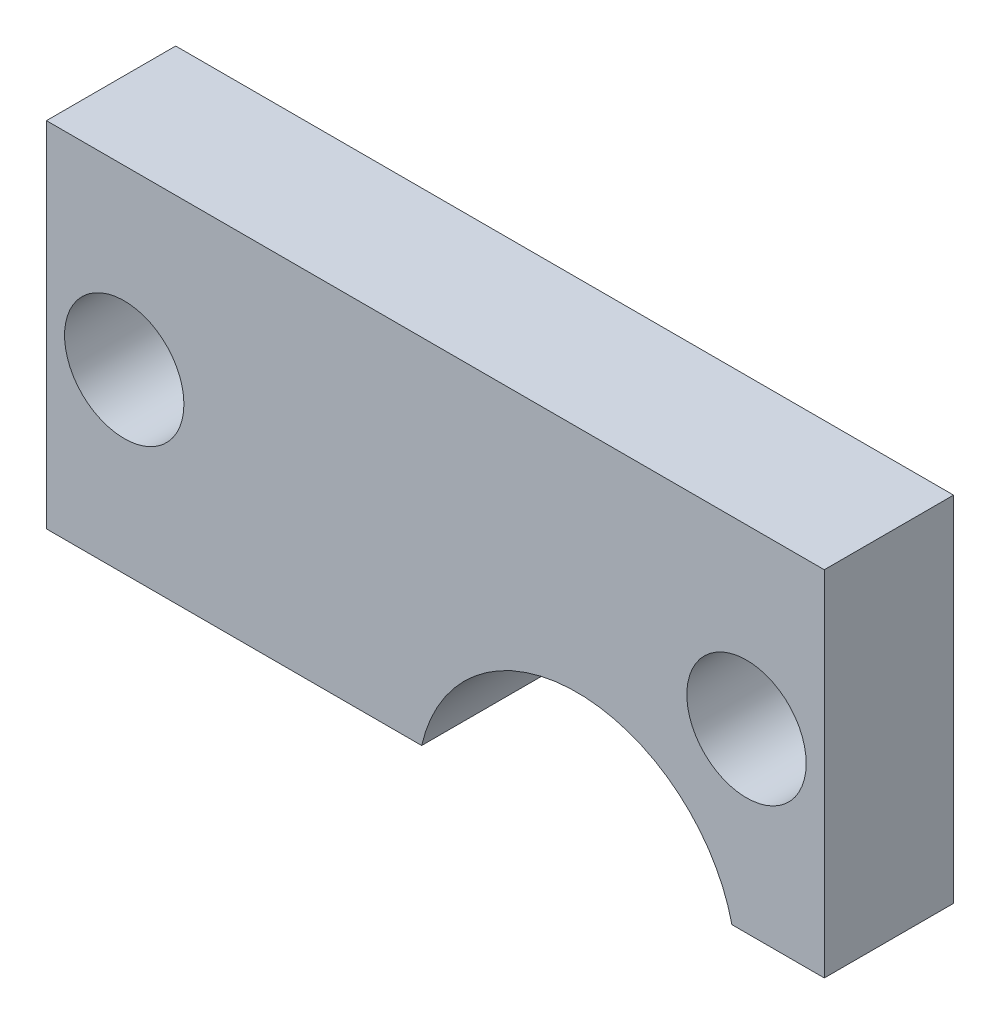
ISO-10303-21;
HEADER;
FILE_DESCRIPTION(('STEP AP214'),'2;1');
FILE_NAME('part.step','',(''),(''),'','','');
FILE_SCHEMA(('AUTOMOTIVE_DESIGN { 1 0 10303 214 1 1 1 1 }'));
ENDSEC;
DATA;
#1=APPLICATION_CONTEXT('core data for automotive mechanical design processes');
#2=APPLICATION_PROTOCOL_DEFINITION('international standard','automotive_design',2000,#1);
#3=PRODUCT_CONTEXT('',#1,'mechanical');
#4=PRODUCT('Part','Part','',(#3));
#5=PRODUCT_RELATED_PRODUCT_CATEGORY('part','',(#4));
#6=PRODUCT_DEFINITION_FORMATION('','',#4);
#7=PRODUCT_DEFINITION_CONTEXT('part definition',#1,'design');
#8=PRODUCT_DEFINITION('design','',#6,#7);
#9=PRODUCT_DEFINITION_SHAPE('','',#8);
#10=(LENGTH_UNIT() NAMED_UNIT(*) SI_UNIT(.MILLI.,.METRE.));
#11=(NAMED_UNIT(*) PLANE_ANGLE_UNIT() SI_UNIT($,.RADIAN.));
#12=(NAMED_UNIT(*) SI_UNIT($,.STERADIAN.) SOLID_ANGLE_UNIT());
#13=UNCERTAINTY_MEASURE_WITH_UNIT(LENGTH_MEASURE(1.E-05),#10,'distance_accuracy_value','');
#14=(GEOMETRIC_REPRESENTATION_CONTEXT(3) GLOBAL_UNCERTAINTY_ASSIGNED_CONTEXT((#13)) GLOBAL_UNIT_ASSIGNED_CONTEXT((#10,
#11,#12)) REPRESENTATION_CONTEXT('',''));
#15=CARTESIAN_POINT('',(0.,0.,0.));
#16=DIRECTION('',(0.,0.,1.));
#17=DIRECTION('',(1.,0.,0.));
#18=AXIS2_PLACEMENT_3D('',#15,#16,#17);
#19=CARTESIAN_POINT('',(-693.42,-152.4,11.6082064));
#20=DIRECTION('',(0.,1.,0.));
#21=DIRECTION('',(0.,0.,1.));
#22=AXIS2_PLACEMENT_3D('',#19,#20,#21);
#23=PLANE('',#22);
#24=DIRECTION('',(1.,0.,0.));
#25=VECTOR('',#24,1.);
#26=CARTESIAN_POINT('',(-693.42,-152.4,0.));
#27=LINE('',#26,#25);
#28=CARTESIAN_POINT('',(-693.42,-152.4,0.));
#29=VERTEX_POINT('',#28);
#30=CARTESIAN_POINT('',(-659.725255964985,-152.4,0.));
#31=VERTEX_POINT('',#30);
#32=EDGE_CURVE('E131',#29,#31,#27,.T.);
#33=ORIENTED_EDGE('',*,*,#32,.T.);
#34=DIRECTION('',(0.,0.,1.));
#35=VECTOR('',#34,1.);
#36=CARTESIAN_POINT('',(-659.725255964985,-152.4,0.));
#37=LINE('',#36,#35);
#38=CARTESIAN_POINT('',(-659.725255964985,-152.4,11.6082064));
#39=VERTEX_POINT('',#38);
#40=EDGE_CURVE('E63',#31,#39,#37,.T.);
#41=ORIENTED_EDGE('',*,*,#40,.T.);
#42=DIRECTION('',(1.,0.,0.));
#43=VECTOR('',#42,1.);
#44=CARTESIAN_POINT('',(-693.42,-152.4,11.6082064));
#45=LINE('',#44,#43);
#46=CARTESIAN_POINT('',(-693.42,-152.4,11.6082064));
#47=VERTEX_POINT('',#46);
#48=EDGE_CURVE('E99',#47,#39,#45,.T.);
#49=ORIENTED_EDGE('',*,*,#48,.F.);
#50=DIRECTION('',(0.,0.,-1.));
#51=VECTOR('',#50,1.);
#52=CARTESIAN_POINT('',(-693.42,-152.4,11.6082064));
#53=LINE('',#52,#51);
#54=EDGE_CURVE('E11',#47,#29,#53,.T.);
#55=ORIENTED_EDGE('',*,*,#54,.T.);
#56=EDGE_LOOP('',(#33,#41,#49,#55));
#57=FACE_BOUND('',#56,.T.);
#58=ADVANCED_FACE('F47',(#57),#23,.F.);
#59=CARTESIAN_POINT('',(-693.42,-120.65,11.6082064));
#60=DIRECTION('',(1.,0.,0.));
#61=DIRECTION('',(0.,0.,-1.));
#62=AXIS2_PLACEMENT_3D('',#59,#60,#61);
#63=PLANE('',#62);
#64=DIRECTION('',(0.,-1.,0.));
#65=VECTOR('',#64,1.);
#66=CARTESIAN_POINT('',(-693.42,-120.65,0.));
#67=LINE('',#66,#65);
#68=CARTESIAN_POINT('',(-693.42,-120.65,0.));
#69=VERTEX_POINT('',#68);
#70=EDGE_CURVE('E132',#69,#29,#67,.T.);
#71=ORIENTED_EDGE('',*,*,#70,.T.);
#72=ORIENTED_EDGE('',*,*,#54,.F.);
#73=DIRECTION('',(0.,-1.,0.));
#74=VECTOR('',#73,1.);
#75=CARTESIAN_POINT('',(-693.42,-120.65,11.6082064));
#76=LINE('',#75,#74);
#77=CARTESIAN_POINT('',(-693.42,-120.65,11.6082064));
#78=VERTEX_POINT('',#77);
#79=EDGE_CURVE('E146',#78,#47,#76,.T.);
#80=ORIENTED_EDGE('',*,*,#79,.F.);
#81=DIRECTION('',(0.,0.,-1.));
#82=VECTOR('',#81,1.);
#83=CARTESIAN_POINT('',(-693.42,-120.65,11.6082064));
#84=LINE('',#83,#82);
#85=EDGE_CURVE('E147',#78,#69,#84,.T.);
#86=ORIENTED_EDGE('',*,*,#85,.T.);
#87=EDGE_LOOP('',(#71,#72,#80,#86));
#88=FACE_BOUND('',#87,.T.);
#89=ADVANCED_FACE('F49',(#88),#63,.F.);
#90=CARTESIAN_POINT('',(-631.864744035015,-152.4,11.6082064));
#91=VERTEX_POINT('',#90);
#92=CARTESIAN_POINT('',(-623.57,-152.4,11.6082064));
#93=VERTEX_POINT('',#92);
#94=EDGE_CURVE('E124',#91,#93,#45,.T.);
#95=ORIENTED_EDGE('',*,*,#94,.F.);
#96=DIRECTION('',(0.,0.,1.));
#97=VECTOR('',#96,1.);
#98=CARTESIAN_POINT('',(-631.864744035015,-152.4,0.));
#99=LINE('',#98,#97);
#100=CARTESIAN_POINT('',(-631.864744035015,-152.4,0.));
#101=VERTEX_POINT('',#100);
#102=EDGE_CURVE('E110',#91,#101,#99,.F.);
#103=ORIENTED_EDGE('',*,*,#102,.T.);
#104=CARTESIAN_POINT('',(-623.57,-152.4,0.));
#105=VERTEX_POINT('',#104);
#106=EDGE_CURVE('E122',#101,#105,#27,.T.);
#107=ORIENTED_EDGE('',*,*,#106,.T.);
#108=DIRECTION('',(0.,0.,-1.));
#109=VECTOR('',#108,1.);
#110=CARTESIAN_POINT('',(-623.57,-152.4,11.6082064));
#111=LINE('',#110,#109);
#112=EDGE_CURVE('E56',#93,#105,#111,.T.);
#113=ORIENTED_EDGE('',*,*,#112,.F.);
#114=EDGE_LOOP('',(#95,#103,#107,#113));
#115=FACE_BOUND('',#114,.T.);
#116=ADVANCED_FACE('F120',(#115),#23,.F.);
#117=CARTESIAN_POINT('',(-623.57,-120.65,11.6082064));
#118=DIRECTION('',(-1.,0.,0.));
#119=DIRECTION('',(0.,0.,1.));
#120=AXIS2_PLACEMENT_3D('',#117,#118,#119);
#121=PLANE('',#120);
#122=DIRECTION('',(0.,1.,0.));
#123=VECTOR('',#122,1.);
#124=CARTESIAN_POINT('',(-623.57,-120.65,0.));
#125=LINE('',#124,#123);
#126=CARTESIAN_POINT('',(-623.57,-120.65,0.));
#127=VERTEX_POINT('',#126);
#128=EDGE_CURVE('E129',#105,#127,#125,.T.);
#129=ORIENTED_EDGE('',*,*,#128,.T.);
#130=DIRECTION('',(0.,0.,-1.));
#131=VECTOR('',#130,1.);
#132=CARTESIAN_POINT('',(-623.57,-120.65,11.6082064));
#133=LINE('',#132,#131);
#134=CARTESIAN_POINT('',(-623.57,-120.65,11.6082064));
#135=VERTEX_POINT('',#134);
#136=EDGE_CURVE('E150',#135,#127,#133,.T.);
#137=ORIENTED_EDGE('',*,*,#136,.F.);
#138=DIRECTION('',(0.,1.,0.));
#139=VECTOR('',#138,1.);
#140=CARTESIAN_POINT('',(-623.57,-120.65,11.6082064));
#141=LINE('',#140,#139);
#142=EDGE_CURVE('E158',#93,#135,#141,.T.);
#143=ORIENTED_EDGE('',*,*,#142,.F.);
#144=ORIENTED_EDGE('',*,*,#112,.T.);
#145=EDGE_LOOP('',(#129,#137,#143,#144));
#146=FACE_BOUND('',#145,.T.);
#147=ADVANCED_FACE('F156',(#146),#121,.F.);
#148=CARTESIAN_POINT('',(-693.42,-120.65,11.6082064));
#149=DIRECTION('',(0.,-1.,0.));
#150=DIRECTION('',(0.,0.,-1.));
#151=AXIS2_PLACEMENT_3D('',#148,#149,#150);
#152=PLANE('',#151);
#153=DIRECTION('',(-1.,0.,0.));
#154=VECTOR('',#153,1.);
#155=CARTESIAN_POINT('',(-693.42,-120.65,0.));
#156=LINE('',#155,#154);
#157=EDGE_CURVE('E93',#127,#69,#156,.T.);
#158=ORIENTED_EDGE('',*,*,#157,.T.);
#159=ORIENTED_EDGE('',*,*,#85,.F.);
#160=DIRECTION('',(-1.,0.,0.));
#161=VECTOR('',#160,1.);
#162=CARTESIAN_POINT('',(-693.42,-120.65,11.6082064));
#163=LINE('',#162,#161);
#164=EDGE_CURVE('E72',#135,#78,#163,.T.);
#165=ORIENTED_EDGE('',*,*,#164,.F.);
#166=ORIENTED_EDGE('',*,*,#136,.T.);
#167=EDGE_LOOP('',(#158,#159,#165,#166));
#168=FACE_BOUND('',#167,.T.);
#169=ADVANCED_FACE('F209',(#168),#152,.F.);
#170=CARTESIAN_POINT('',(0.,0.,11.6082064));
#171=DIRECTION('',(0.,0.,1.));
#172=DIRECTION('',(1.,0.,0.));
#173=AXIS2_PLACEMENT_3D('',#170,#171,#172);
#174=PLANE('',#173);
#175=CARTESIAN_POINT('',(-645.795,-155.575,11.6082064));
#176=DIRECTION('',(0.,0.,1.));
#177=DIRECTION('',(1.,0.,0.));
#178=AXIS2_PLACEMENT_3D('',#175,#176,#177);
#179=CIRCLE('',#178,14.2875);
#180=EDGE_CURVE('E116',#91,#39,#179,.T.);
#181=ORIENTED_EDGE('',*,*,#180,.F.);
#182=ORIENTED_EDGE('',*,*,#94,.T.);
#183=ORIENTED_EDGE('',*,*,#142,.T.);
#184=ORIENTED_EDGE('',*,*,#164,.T.);
#185=ORIENTED_EDGE('',*,*,#79,.T.);
#186=ORIENTED_EDGE('',*,*,#48,.T.);
#187=EDGE_LOOP('',(#181,#182,#183,#184,#185,#186));
#188=FACE_BOUND('',#187,.T.);
#189=CARTESIAN_POINT('',(-686.435,-136.525,11.6082064));
#190=DIRECTION('',(0.,0.,1.));
#191=DIRECTION('',(1.,0.,0.));
#192=AXIS2_PLACEMENT_3D('',#189,#190,#191);
#193=CIRCLE('',#192,5.35940000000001);
#194=CARTESIAN_POINT('',(-681.0756,-136.525,11.6082064));
#195=VERTEX_POINT('',#194);
#196=EDGE_CURVE('E183',#195,#195,#193,.T.);
#197=ORIENTED_EDGE('',*,*,#196,.F.);
#198=EDGE_LOOP('',(#197));
#199=FACE_BOUND('',#198,.T.);
#200=CARTESIAN_POINT('',(-630.555,-136.525,11.6082064));
#201=DIRECTION('',(0.,0.,1.));
#202=DIRECTION('',(1.,0.,0.));
#203=AXIS2_PLACEMENT_3D('',#200,#201,#202);
#204=CIRCLE('',#203,5.35940000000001);
#205=CARTESIAN_POINT('',(-625.1956,-136.525,11.6082064));
#206=VERTEX_POINT('',#205);
#207=EDGE_CURVE('E138',#206,#206,#204,.T.);
#208=ORIENTED_EDGE('',*,*,#207,.F.);
#209=EDGE_LOOP('',(#208));
#210=FACE_BOUND('',#209,.T.);
#211=ADVANCED_FACE('F203',(#188,#199,#210),#174,.T.);
#212=CARTESIAN_POINT('',(0.,0.,0.));
#213=DIRECTION('',(0.,0.,1.));
#214=DIRECTION('',(1.,0.,0.));
#215=AXIS2_PLACEMENT_3D('',#212,#213,#214);
#216=PLANE('',#215);
#217=CARTESIAN_POINT('',(-686.435,-136.525,0.));
#218=DIRECTION('',(0.,0.,1.));
#219=DIRECTION('',(1.,0.,0.));
#220=AXIS2_PLACEMENT_3D('',#217,#218,#219);
#221=CIRCLE('',#220,3.56869999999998);
#222=CARTESIAN_POINT('',(-682.8663,-136.525,0.));
#223=VERTEX_POINT('',#222);
#224=EDGE_CURVE('E195',#223,#223,#221,.T.);
#225=ORIENTED_EDGE('',*,*,#224,.T.);
#226=EDGE_LOOP('',(#225));
#227=FACE_BOUND('',#226,.T.);
#228=CARTESIAN_POINT('',(-630.555,-136.525,0.));
#229=DIRECTION('',(0.,0.,1.));
#230=DIRECTION('',(1.,0.,0.));
#231=AXIS2_PLACEMENT_3D('',#228,#229,#230);
#232=CIRCLE('',#231,3.56869999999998);
#233=CARTESIAN_POINT('',(-626.9863,-136.525,0.));
#234=VERTEX_POINT('',#233);
#235=EDGE_CURVE('E179',#234,#234,#232,.T.);
#236=ORIENTED_EDGE('',*,*,#235,.T.);
#237=EDGE_LOOP('',(#236));
#238=FACE_BOUND('',#237,.T.);
#239=ORIENTED_EDGE('',*,*,#106,.F.);
#240=CARTESIAN_POINT('',(-645.795,-155.575,0.));
#241=DIRECTION('',(0.,0.,1.));
#242=DIRECTION('',(1.,0.,0.));
#243=AXIS2_PLACEMENT_3D('',#240,#241,#242);
#244=CIRCLE('',#243,14.2875);
#245=EDGE_CURVE('E107',#101,#31,#244,.T.);
#246=ORIENTED_EDGE('',*,*,#245,.T.);
#247=ORIENTED_EDGE('',*,*,#32,.F.);
#248=ORIENTED_EDGE('',*,*,#70,.F.);
#249=ORIENTED_EDGE('',*,*,#157,.F.);
#250=ORIENTED_EDGE('',*,*,#128,.F.);
#251=EDGE_LOOP('',(#239,#246,#247,#248,#249,#250));
#252=FACE_BOUND('',#251,.T.);
#253=ADVANCED_FACE('F128',(#227,#238,#252),#216,.F.);
#254=CARTESIAN_POINT('',(-630.555,-136.525,11.6082064));
#255=DIRECTION('',(0.,0.,1.));
#256=DIRECTION('',(1.,0.,0.));
#257=AXIS2_PLACEMENT_3D('',#254,#255,#256);
#258=CYLINDRICAL_SURFACE('',#257,5.35940000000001);
#259=CARTESIAN_POINT('',(-630.555,-136.525,3.7342064));
#260=DIRECTION('',(0.,0.,1.));
#261=DIRECTION('',(1.,0.,0.));
#262=AXIS2_PLACEMENT_3D('',#259,#260,#261);
#263=CIRCLE('',#262,5.35940000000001);
#264=CARTESIAN_POINT('',(-625.1956,-136.525,3.7342064));
#265=VERTEX_POINT('',#264);
#266=EDGE_CURVE('E171',#265,#265,#263,.T.);
#267=ORIENTED_EDGE('',*,*,#266,.F.);
#268=EDGE_LOOP('',(#267));
#269=FACE_BOUND('',#268,.T.);
#270=ORIENTED_EDGE('',*,*,#207,.T.);
#271=EDGE_LOOP('',(#270));
#272=FACE_BOUND('',#271,.T.);
#273=ADVANCED_FACE('F253',(#269,#272),#258,.F.);
#274=CARTESIAN_POINT('',(-626.9863,-136.525,3.7342064));
#275=DIRECTION('',(0.,0.,-1.));
#276=DIRECTION('',(-1.,0.,0.));
#277=AXIS2_PLACEMENT_3D('',#274,#275,#276);
#278=PLANE('',#277);
#279=CARTESIAN_POINT('',(-630.555,-136.525,3.7342064));
#280=DIRECTION('',(0.,0.,1.));
#281=DIRECTION('',(1.,0.,0.));
#282=AXIS2_PLACEMENT_3D('',#279,#280,#281);
#283=CIRCLE('',#282,3.56869999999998);
#284=CARTESIAN_POINT('',(-626.9863,-136.525,3.7342064));
#285=VERTEX_POINT('',#284);
#286=EDGE_CURVE('E175',#285,#285,#283,.T.);
#287=ORIENTED_EDGE('',*,*,#286,.F.);
#288=EDGE_LOOP('',(#287));
#289=FACE_BOUND('',#288,.T.);
#290=ORIENTED_EDGE('',*,*,#266,.T.);
#291=EDGE_LOOP('',(#290));
#292=FACE_BOUND('',#291,.T.);
#293=ADVANCED_FACE('F263',(#289,#292),#278,.F.);
#294=CARTESIAN_POINT('',(-630.555,-136.525,11.6082064));
#295=DIRECTION('',(0.,0.,1.));
#296=DIRECTION('',(1.,0.,0.));
#297=AXIS2_PLACEMENT_3D('',#294,#295,#296);
#298=CYLINDRICAL_SURFACE('',#297,3.56869999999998);
#299=ORIENTED_EDGE('',*,*,#235,.F.);
#300=EDGE_LOOP('',(#299));
#301=FACE_BOUND('',#300,.T.);
#302=ORIENTED_EDGE('',*,*,#286,.T.);
#303=EDGE_LOOP('',(#302));
#304=FACE_BOUND('',#303,.T.);
#305=ADVANCED_FACE('F275',(#301,#304),#298,.F.);
#306=CARTESIAN_POINT('',(-686.435,-136.525,11.6082064));
#307=DIRECTION('',(0.,0.,1.));
#308=DIRECTION('',(1.,0.,0.));
#309=AXIS2_PLACEMENT_3D('',#306,#307,#308);
#310=CYLINDRICAL_SURFACE('',#309,5.35940000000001);
#311=CARTESIAN_POINT('',(-686.435,-136.525,3.7342064));
#312=DIRECTION('',(0.,0.,1.));
#313=DIRECTION('',(1.,0.,0.));
#314=AXIS2_PLACEMENT_3D('',#311,#312,#313);
#315=CIRCLE('',#314,5.35940000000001);
#316=CARTESIAN_POINT('',(-681.0756,-136.525,3.7342064));
#317=VERTEX_POINT('',#316);
#318=EDGE_CURVE('E187',#317,#317,#315,.T.);
#319=ORIENTED_EDGE('',*,*,#318,.F.);
#320=EDGE_LOOP('',(#319));
#321=FACE_BOUND('',#320,.T.);
#322=ORIENTED_EDGE('',*,*,#196,.T.);
#323=EDGE_LOOP('',(#322));
#324=FACE_BOUND('',#323,.T.);
#325=ADVANCED_FACE('F285',(#321,#324),#310,.F.);
#326=CARTESIAN_POINT('',(-682.8663,-136.525,3.7342064));
#327=DIRECTION('',(0.,0.,-1.));
#328=DIRECTION('',(-1.,0.,0.));
#329=AXIS2_PLACEMENT_3D('',#326,#327,#328);
#330=PLANE('',#329);
#331=CARTESIAN_POINT('',(-686.435,-136.525,3.7342064));
#332=DIRECTION('',(0.,0.,1.));
#333=DIRECTION('',(1.,0.,0.));
#334=AXIS2_PLACEMENT_3D('',#331,#332,#333);
#335=CIRCLE('',#334,3.56869999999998);
#336=CARTESIAN_POINT('',(-682.8663,-136.525,3.7342064));
#337=VERTEX_POINT('',#336);
#338=EDGE_CURVE('E191',#337,#337,#335,.T.);
#339=ORIENTED_EDGE('',*,*,#338,.F.);
#340=EDGE_LOOP('',(#339));
#341=FACE_BOUND('',#340,.T.);
#342=ORIENTED_EDGE('',*,*,#318,.T.);
#343=EDGE_LOOP('',(#342));
#344=FACE_BOUND('',#343,.T.);
#345=ADVANCED_FACE('F297',(#341,#344),#330,.F.);
#346=CARTESIAN_POINT('',(-686.435,-136.525,11.6082064));
#347=DIRECTION('',(0.,0.,1.));
#348=DIRECTION('',(1.,0.,0.));
#349=AXIS2_PLACEMENT_3D('',#346,#347,#348);
#350=CYLINDRICAL_SURFACE('',#349,3.56869999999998);
#351=ORIENTED_EDGE('',*,*,#224,.F.);
#352=EDGE_LOOP('',(#351));
#353=FACE_BOUND('',#352,.T.);
#354=ORIENTED_EDGE('',*,*,#338,.T.);
#355=EDGE_LOOP('',(#354));
#356=FACE_BOUND('',#355,.T.);
#357=ADVANCED_FACE('F308',(#353,#356),#350,.F.);
#358=CARTESIAN_POINT('',(-645.795,-155.575,0.));
#359=DIRECTION('',(0.,0.,1.));
#360=DIRECTION('',(1.,0.,0.));
#361=AXIS2_PLACEMENT_3D('',#358,#359,#360);
#362=CYLINDRICAL_SURFACE('',#361,14.2875);
#363=ORIENTED_EDGE('',*,*,#245,.F.);
#364=ORIENTED_EDGE('',*,*,#102,.F.);
#365=ORIENTED_EDGE('',*,*,#180,.T.);
#366=ORIENTED_EDGE('',*,*,#40,.F.);
#367=EDGE_LOOP('',(#363,#364,#365,#366));
#368=FACE_BOUND('',#367,.T.);
#369=ADVANCED_FACE('F109',(#368),#362,.F.);
#370=CLOSED_SHELL('',(#58,#89,#116,#147,#169,#211,#253,#273,#293,#305,#325,#345,#357,#369));
#371=MANIFOLD_SOLID_BREP('B2',#370);
#372=ADVANCED_BREP_SHAPE_REPRESENTATION('',(#18,#371),#14);
#373=SHAPE_DEFINITION_REPRESENTATION(#9,#372);
ENDSEC;
END-ISO-10303-21;
